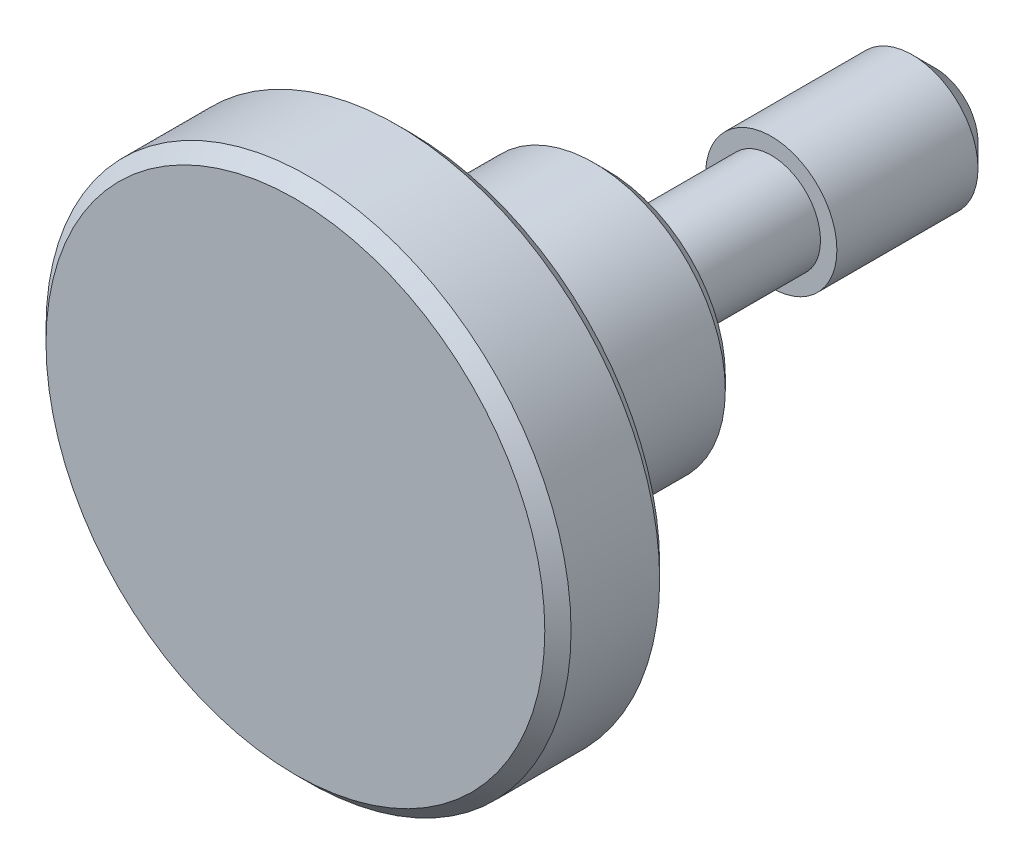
ISO-10303-21;
HEADER;
FILE_DESCRIPTION(('STEP AP214'),'2;1');
FILE_NAME('part.step','',(''),(''),'','','');
FILE_SCHEMA(('AUTOMOTIVE_DESIGN { 1 0 10303 214 1 1 1 1 }'));
ENDSEC;
DATA;
#1=APPLICATION_CONTEXT('core data for automotive mechanical design processes');
#2=APPLICATION_PROTOCOL_DEFINITION('international standard','automotive_design',2000,#1);
#3=PRODUCT_CONTEXT('',#1,'mechanical');
#4=PRODUCT('Part','Part','',(#3));
#5=PRODUCT_RELATED_PRODUCT_CATEGORY('part','',(#4));
#6=PRODUCT_DEFINITION_FORMATION('','',#4);
#7=PRODUCT_DEFINITION_CONTEXT('part definition',#1,'design');
#8=PRODUCT_DEFINITION('design','',#6,#7);
#9=PRODUCT_DEFINITION_SHAPE('','',#8);
#10=(LENGTH_UNIT() NAMED_UNIT(*) SI_UNIT(.MILLI.,.METRE.));
#11=(NAMED_UNIT(*) PLANE_ANGLE_UNIT() SI_UNIT($,.RADIAN.));
#12=(NAMED_UNIT(*) SI_UNIT($,.STERADIAN.) SOLID_ANGLE_UNIT());
#13=UNCERTAINTY_MEASURE_WITH_UNIT(LENGTH_MEASURE(1.E-05),#10,'distance_accuracy_value','');
#14=(GEOMETRIC_REPRESENTATION_CONTEXT(3) GLOBAL_UNCERTAINTY_ASSIGNED_CONTEXT((#13)) GLOBAL_UNIT_ASSIGNED_CONTEXT((#10,
#11,#12)) REPRESENTATION_CONTEXT('',''));
#15=CARTESIAN_POINT('',(0.,0.,0.));
#16=DIRECTION('',(0.,0.,1.));
#17=DIRECTION('',(1.,0.,0.));
#18=AXIS2_PLACEMENT_3D('',#15,#16,#17);
#19=CARTESIAN_POINT('',(0.,-1.11022302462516E-13,-9.99999999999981));
#20=DIRECTION('',(0.,0.,1.));
#21=DIRECTION('',(1.,0.,0.));
#22=AXIS2_PLACEMENT_3D('',#19,#20,#21);
#23=PLANE('',#22);
#24=CARTESIAN_POINT('',(0.,-1.11022302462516E-13,-9.99999999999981));
#25=DIRECTION('',(0.,0.,1.));
#26=DIRECTION('',(1.,0.,0.));
#27=AXIS2_PLACEMENT_3D('',#24,#25,#26);
#28=CIRCLE('',#27,1.3000038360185);
#29=CARTESIAN_POINT('',(1.3000038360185,-1.11022302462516E-13,-9.99999999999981));
#30=VERTEX_POINT('',#29);
#31=EDGE_CURVE('E8',#30,#30,#28,.T.);
#32=ORIENTED_EDGE('',*,*,#31,.F.);
#33=EDGE_LOOP('',(#32));
#34=FACE_BOUND('',#33,.T.);
#35=ADVANCED_FACE('F12',(#34),#23,.F.);
#36=CARTESIAN_POINT('',(0.,-1.11022302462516E-13,-9.99999999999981));
#37=DIRECTION('',(0.,0.,1.));
#38=DIRECTION('',(1.,0.,0.));
#39=AXIS2_PLACEMENT_3D('',#36,#37,#38);
#40=CONICAL_SURFACE('',#39,1.3000038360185,0.785398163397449);
#41=CARTESIAN_POINT('',(0.,-1.11022302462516E-13,-9.29999999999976));
#42=DIRECTION('',(0.,0.,1.));
#43=DIRECTION('',(1.,0.,0.));
#44=AXIS2_PLACEMENT_3D('',#41,#42,#43);
#45=CIRCLE('',#44,2.00000383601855);
#46=CARTESIAN_POINT('',(2.00000383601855,-1.11022302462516E-13,-9.29999999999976));
#47=VERTEX_POINT('',#46);
#48=EDGE_CURVE('E18',#47,#47,#45,.T.);
#49=ORIENTED_EDGE('',*,*,#48,.F.);
#50=EDGE_LOOP('',(#49));
#51=FACE_BOUND('',#50,.T.);
#52=ORIENTED_EDGE('',*,*,#31,.T.);
#53=EDGE_LOOP('',(#52));
#54=FACE_BOUND('',#53,.T.);
#55=ADVANCED_FACE('F132',(#51,#54),#40,.T.);
#56=CARTESIAN_POINT('',(0.,-1.11022302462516E-13,12.));
#57=DIRECTION('',(0.,0.,1.));
#58=DIRECTION('',(1.,0.,0.));
#59=AXIS2_PLACEMENT_3D('',#56,#57,#58);
#60=CYLINDRICAL_SURFACE('',#59,2.00000383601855);
#61=CARTESIAN_POINT('',(0.,-1.11022302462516E-13,-4.9999999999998));
#62=DIRECTION('',(0.,0.,1.));
#63=DIRECTION('',(1.,0.,0.));
#64=AXIS2_PLACEMENT_3D('',#61,#62,#63);
#65=CIRCLE('',#64,2.00000383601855);
#66=CARTESIAN_POINT('',(2.00000383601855,-1.11022302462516E-13,-4.9999999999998));
#67=VERTEX_POINT('',#66);
#68=EDGE_CURVE('E22',#67,#67,#65,.T.);
#69=ORIENTED_EDGE('',*,*,#68,.F.);
#70=EDGE_LOOP('',(#69));
#71=FACE_BOUND('',#70,.T.);
#72=ORIENTED_EDGE('',*,*,#48,.T.);
#73=EDGE_LOOP('',(#72));
#74=FACE_BOUND('',#73,.T.);
#75=ADVANCED_FACE('F127',(#71,#74),#60,.T.);
#76=CARTESIAN_POINT('',(0.,1.49999999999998,-4.9999999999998));
#77=DIRECTION('',(0.,0.,-1.));
#78=DIRECTION('',(-1.,0.,0.));
#79=AXIS2_PLACEMENT_3D('',#76,#77,#78);
#80=PLANE('',#79);
#81=CARTESIAN_POINT('',(0.,-1.11022302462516E-13,-4.9999999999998));
#82=DIRECTION('',(0.,0.,1.));
#83=DIRECTION('',(1.,0.,0.));
#84=AXIS2_PLACEMENT_3D('',#81,#82,#83);
#85=CIRCLE('',#84,1.50000000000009);
#86=CARTESIAN_POINT('',(1.50000000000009,-1.11022302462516E-13,-4.9999999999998));
#87=VERTEX_POINT('',#86);
#88=EDGE_CURVE('E26',#87,#87,#85,.T.);
#89=ORIENTED_EDGE('',*,*,#88,.F.);
#90=EDGE_LOOP('',(#89));
#91=FACE_BOUND('',#90,.T.);
#92=ORIENTED_EDGE('',*,*,#68,.T.);
#93=EDGE_LOOP('',(#92));
#94=FACE_BOUND('',#93,.T.);
#95=ADVANCED_FACE('F121',(#91,#94),#80,.F.);
#96=CARTESIAN_POINT('',(0.,-1.11022302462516E-13,12.));
#97=DIRECTION('',(0.,0.,1.));
#98=DIRECTION('',(1.,0.,0.));
#99=AXIS2_PLACEMENT_3D('',#96,#97,#98);
#100=CYLINDRICAL_SURFACE('',#99,1.50000000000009);
#101=CARTESIAN_POINT('',(0.,-1.11022302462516E-13,-0.399999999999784));
#102=DIRECTION('',(0.,0.,1.));
#103=DIRECTION('',(1.,0.,0.));
#104=AXIS2_PLACEMENT_3D('',#101,#102,#103);
#105=CIRCLE('',#104,1.50000000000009);
#106=CARTESIAN_POINT('',(1.50000000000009,-1.11022302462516E-13,-0.399999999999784));
#107=VERTEX_POINT('',#106);
#108=EDGE_CURVE('E31',#107,#107,#105,.T.);
#109=ORIENTED_EDGE('',*,*,#108,.F.);
#110=EDGE_LOOP('',(#109));
#111=FACE_BOUND('',#110,.T.);
#112=ORIENTED_EDGE('',*,*,#88,.T.);
#113=EDGE_LOOP('',(#112));
#114=FACE_BOUND('',#113,.T.);
#115=ADVANCED_FACE('F115',(#111,#114),#100,.T.);
#116=CARTESIAN_POINT('',(0.,-1.11022302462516E-13,-0.399999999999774));
#117=DIRECTION('',(0.,0.,1.));
#118=DIRECTION('',(1.,0.,0.));
#119=AXIS2_PLACEMENT_3D('',#116,#117,#118);
#120=TOROIDAL_SURFACE('',#119,1.90000000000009,0.4);
#121=CARTESIAN_POINT('',(0.,-1.11022302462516E-13,2.23779328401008E-13));
#122=DIRECTION('',(0.,0.,1.));
#123=DIRECTION('',(1.,0.,0.));
#124=AXIS2_PLACEMENT_3D('',#121,#122,#123);
#125=CIRCLE('',#124,1.90000000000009);
#126=CARTESIAN_POINT('',(1.90000000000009,-1.11022302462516E-13,2.23779328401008E-13));
#127=VERTEX_POINT('',#126);
#128=EDGE_CURVE('E34',#127,#127,#125,.T.);
#129=ORIENTED_EDGE('',*,*,#128,.F.);
#130=EDGE_LOOP('',(#129));
#131=FACE_BOUND('',#130,.T.);
#132=ORIENTED_EDGE('',*,*,#108,.T.);
#133=EDGE_LOOP('',(#132));
#134=FACE_BOUND('',#133,.T.);
#135=ADVANCED_FACE('F109',(#131,#134),#120,.F.);
#136=CARTESIAN_POINT('',(0.,1.9,2.24046116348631E-13));
#137=DIRECTION('',(0.,0.,1.));
#138=DIRECTION('',(1.,0.,0.));
#139=AXIS2_PLACEMENT_3D('',#136,#137,#138);
#140=PLANE('',#139);
#141=CARTESIAN_POINT('',(0.,-1.11022302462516E-13,2.23779328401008E-13));
#142=DIRECTION('',(0.,0.,1.));
#143=DIRECTION('',(1.,0.,0.));
#144=AXIS2_PLACEMENT_3D('',#141,#142,#143);
#145=CIRCLE('',#144,3.6000000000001);
#146=CARTESIAN_POINT('',(3.6000000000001,-1.11022302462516E-13,2.23779328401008E-13));
#147=VERTEX_POINT('',#146);
#148=EDGE_CURVE('E37',#147,#147,#145,.T.);
#149=ORIENTED_EDGE('',*,*,#148,.F.);
#150=EDGE_LOOP('',(#149));
#151=FACE_BOUND('',#150,.T.);
#152=ORIENTED_EDGE('',*,*,#128,.T.);
#153=EDGE_LOOP('',(#152));
#154=FACE_BOUND('',#153,.T.);
#155=ADVANCED_FACE('F103',(#151,#154),#140,.F.);
#156=CARTESIAN_POINT('',(0.,-1.11022302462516E-13,2.23779328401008E-13));
#157=DIRECTION('',(0.,0.,1.));
#158=DIRECTION('',(1.,0.,0.));
#159=AXIS2_PLACEMENT_3D('',#156,#157,#158);
#160=CONICAL_SURFACE('',#159,3.6000000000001,0.785398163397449);
#161=CARTESIAN_POINT('',(0.,-1.11022302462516E-13,0.400000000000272));
#162=DIRECTION('',(0.,0.,1.));
#163=DIRECTION('',(1.,0.,0.));
#164=AXIS2_PLACEMENT_3D('',#161,#162,#163);
#165=CIRCLE('',#164,4.00000000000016);
#166=CARTESIAN_POINT('',(4.00000000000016,-1.11022302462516E-13,0.400000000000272));
#167=VERTEX_POINT('',#166);
#168=EDGE_CURVE('E40',#167,#167,#165,.T.);
#169=ORIENTED_EDGE('',*,*,#168,.F.);
#170=EDGE_LOOP('',(#169));
#171=FACE_BOUND('',#170,.T.);
#172=ORIENTED_EDGE('',*,*,#148,.T.);
#173=EDGE_LOOP('',(#172));
#174=FACE_BOUND('',#173,.T.);
#175=ADVANCED_FACE('F97',(#171,#174),#160,.T.);
#176=CARTESIAN_POINT('',(0.,-1.11022302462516E-13,12.));
#177=DIRECTION('',(0.,0.,1.));
#178=DIRECTION('',(1.,0.,0.));
#179=AXIS2_PLACEMENT_3D('',#176,#177,#178);
#180=CYLINDRICAL_SURFACE('',#179,4.00000000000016);
#181=CARTESIAN_POINT('',(0.,-1.11022302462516E-13,5.50000000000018));
#182=DIRECTION('',(0.,0.,1.));
#183=DIRECTION('',(1.,0.,0.));
#184=AXIS2_PLACEMENT_3D('',#181,#182,#183);
#185=CIRCLE('',#184,4.00000000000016);
#186=CARTESIAN_POINT('',(4.00000000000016,-1.11022302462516E-13,5.50000000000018));
#187=VERTEX_POINT('',#186);
#188=EDGE_CURVE('E43',#187,#187,#185,.T.);
#189=ORIENTED_EDGE('',*,*,#188,.F.);
#190=EDGE_LOOP('',(#189));
#191=FACE_BOUND('',#190,.T.);
#192=ORIENTED_EDGE('',*,*,#168,.T.);
#193=EDGE_LOOP('',(#192));
#194=FACE_BOUND('',#193,.T.);
#195=ADVANCED_FACE('F91',(#191,#194),#180,.T.);
#196=CARTESIAN_POINT('',(0.,-1.11022302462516E-13,5.50000000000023));
#197=DIRECTION('',(0.,0.,1.));
#198=DIRECTION('',(1.,0.,0.));
#199=AXIS2_PLACEMENT_3D('',#196,#197,#198);
#200=TOROIDAL_SURFACE('',#199,4.50000000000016,0.5);
#201=CARTESIAN_POINT('',(0.,-1.11022302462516E-13,6.00000000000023));
#202=DIRECTION('',(0.,0.,1.));
#203=DIRECTION('',(1.,0.,0.));
#204=AXIS2_PLACEMENT_3D('',#201,#202,#203);
#205=CIRCLE('',#204,4.50000000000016);
#206=CARTESIAN_POINT('',(4.50000000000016,-1.11022302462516E-13,6.00000000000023));
#207=VERTEX_POINT('',#206);
#208=EDGE_CURVE('E46',#207,#207,#205,.T.);
#209=ORIENTED_EDGE('',*,*,#208,.F.);
#210=EDGE_LOOP('',(#209));
#211=FACE_BOUND('',#210,.T.);
#212=ORIENTED_EDGE('',*,*,#188,.T.);
#213=EDGE_LOOP('',(#212));
#214=FACE_BOUND('',#213,.T.);
#215=ADVANCED_FACE('F85',(#211,#214),#200,.F.);
#216=CARTESIAN_POINT('',(0.,4.5,6.00000000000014));
#217=DIRECTION('',(0.,0.,1.));
#218=DIRECTION('',(1.,0.,0.));
#219=AXIS2_PLACEMENT_3D('',#216,#217,#218);
#220=PLANE('',#219);
#221=CARTESIAN_POINT('',(0.,-1.11022302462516E-13,6.));
#222=DIRECTION('',(0.,0.,1.));
#223=DIRECTION('',(1.,0.,0.));
#224=AXIS2_PLACEMENT_3D('',#221,#222,#223);
#225=CIRCLE('',#224,7.60000000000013);
#226=CARTESIAN_POINT('',(7.60000000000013,-1.11022302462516E-13,6.));
#227=VERTEX_POINT('',#226);
#228=EDGE_CURVE('E49',#227,#227,#225,.T.);
#229=ORIENTED_EDGE('',*,*,#228,.F.);
#230=EDGE_LOOP('',(#229));
#231=FACE_BOUND('',#230,.T.);
#232=ORIENTED_EDGE('',*,*,#208,.T.);
#233=EDGE_LOOP('',(#232));
#234=FACE_BOUND('',#233,.T.);
#235=ADVANCED_FACE('F79',(#231,#234),#220,.F.);
#236=CARTESIAN_POINT('',(0.,-1.11022302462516E-13,6.));
#237=DIRECTION('',(0.,0.,1.));
#238=DIRECTION('',(1.,0.,0.));
#239=AXIS2_PLACEMENT_3D('',#236,#237,#238);
#240=CONICAL_SURFACE('',#239,7.60000000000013,0.785398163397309);
#241=CARTESIAN_POINT('',(0.,-1.11022302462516E-13,6.4));
#242=DIRECTION('',(0.,0.,1.));
#243=DIRECTION('',(1.,0.,0.));
#244=AXIS2_PLACEMENT_3D('',#241,#242,#243);
#245=CIRCLE('',#244,8.);
#246=CARTESIAN_POINT('',(8.,-1.11022302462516E-13,6.4));
#247=VERTEX_POINT('',#246);
#248=EDGE_CURVE('E52',#247,#247,#245,.T.);
#249=ORIENTED_EDGE('',*,*,#248,.F.);
#250=EDGE_LOOP('',(#249));
#251=FACE_BOUND('',#250,.T.);
#252=ORIENTED_EDGE('',*,*,#228,.T.);
#253=EDGE_LOOP('',(#252));
#254=FACE_BOUND('',#253,.T.);
#255=ADVANCED_FACE('F73',(#251,#254),#240,.T.);
#256=CARTESIAN_POINT('',(0.,-1.11022302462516E-13,12.));
#257=DIRECTION('',(0.,0.,1.));
#258=DIRECTION('',(1.,0.,0.));
#259=AXIS2_PLACEMENT_3D('',#256,#257,#258);
#260=CYLINDRICAL_SURFACE('',#259,8.);
#261=CARTESIAN_POINT('',(0.,-1.11022302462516E-13,9.1));
#262=DIRECTION('',(0.,0.,1.));
#263=DIRECTION('',(1.,0.,0.));
#264=AXIS2_PLACEMENT_3D('',#261,#262,#263);
#265=CIRCLE('',#264,8.);
#266=CARTESIAN_POINT('',(8.,-1.11022302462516E-13,9.1));
#267=VERTEX_POINT('',#266);
#268=EDGE_CURVE('E55',#267,#267,#265,.T.);
#269=ORIENTED_EDGE('',*,*,#268,.F.);
#270=EDGE_LOOP('',(#269));
#271=FACE_BOUND('',#270,.T.);
#272=ORIENTED_EDGE('',*,*,#248,.T.);
#273=EDGE_LOOP('',(#272));
#274=FACE_BOUND('',#273,.T.);
#275=ADVANCED_FACE('F67',(#271,#274),#260,.T.);
#276=CARTESIAN_POINT('',(0.,-1.11022302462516E-13,9.1));
#277=DIRECTION('',(0.,0.,-1.));
#278=DIRECTION('',(-1.,0.,0.));
#279=AXIS2_PLACEMENT_3D('',#276,#277,#278);
#280=CONICAL_SURFACE('',#279,8.,0.785398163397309);
#281=CARTESIAN_POINT('',(0.,-1.11022302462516E-13,9.5));
#282=DIRECTION('',(0.,0.,1.));
#283=DIRECTION('',(1.,0.,0.));
#284=AXIS2_PLACEMENT_3D('',#281,#282,#283);
#285=CIRCLE('',#284,7.60000000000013);
#286=CARTESIAN_POINT('',(7.60000000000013,-1.11022302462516E-13,9.5));
#287=VERTEX_POINT('',#286);
#288=EDGE_CURVE('E58',#287,#287,#285,.T.);
#289=ORIENTED_EDGE('',*,*,#288,.F.);
#290=EDGE_LOOP('',(#289));
#291=FACE_BOUND('',#290,.T.);
#292=ORIENTED_EDGE('',*,*,#268,.T.);
#293=EDGE_LOOP('',(#292));
#294=FACE_BOUND('',#293,.T.);
#295=ADVANCED_FACE('F64',(#291,#294),#280,.T.);
#296=CARTESIAN_POINT('',(0.,-1.11022302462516E-13,9.5));
#297=DIRECTION('',(0.,0.,-1.));
#298=DIRECTION('',(-1.,0.,0.));
#299=AXIS2_PLACEMENT_3D('',#296,#297,#298);
#300=PLANE('',#299);
#301=ORIENTED_EDGE('',*,*,#288,.T.);
#302=EDGE_LOOP('',(#301));
#303=FACE_BOUND('',#302,.T.);
#304=ADVANCED_FACE('F62',(#303),#300,.F.);
#305=CLOSED_SHELL('',(#35,#55,#75,#95,#115,#135,#155,#175,#195,#215,#235,#255,#275,#295,#304));
#306=MANIFOLD_SOLID_BREP('B1',#305);
#307=ADVANCED_BREP_SHAPE_REPRESENTATION('',(#18,#306),#14);
#308=SHAPE_DEFINITION_REPRESENTATION(#9,#307);
ENDSEC;
END-ISO-10303-21;
